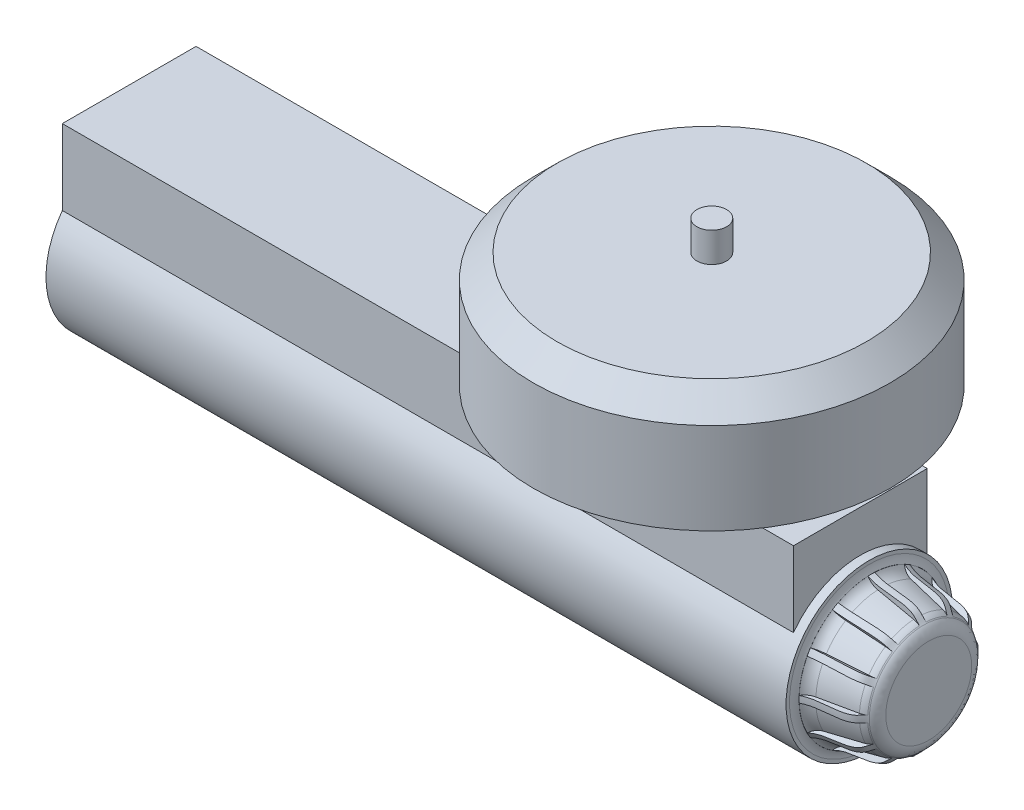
from build123d import *

# Parameters (mm, degrees)
SKETCH_1_R          = 60.05
EXTRUDE_1_DEPTH     = 49.2
SKETCH_2_W          = 246
SKETCH_2_H          = 45
EXTRUDE_2_DEPTH     = 42
SKETCH_3_R          = 28
SKETCH_3_R_2        = 25
EXTRUDE_3_DEPTH     = 246
SKETCH_4_R          = 25
CUT_EXTRUDE_1_DEPTH = 263.720388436
SKETCH_5_R          = 5
EXTRUDE_4_DEPTH     = 10
EXTRUDE_START       = 3
SKETCH_6_R          = 28
EXTRUDE_5_DEPTH     = 3
SKETCH_7_R          = 22.794562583
EXTRUDE_6_DEPTH     = 20
EXTRUDE_6_TAPER     = 12
FILLET_1_R          = 5
FILLET_2_R          = 5
EXTRUDE_7_REACH     = 286.371
SKETCH_8_W          = 2.21161749
SKETCH_8_H          = 9.865962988
SKETCH_8_W_2        = 9.865962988
SKETCH_8_H_2        = 2.21161749
CHAMFER_1_SIZE      = 8
SKETCH_12_R         = 60.05
SKETCH_12_R_2       = 26.947600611
CUT_EXTRUDE_3_DEPTH = 0.5
CHAMFER_2_SIZE      = 10
CHAMFER_2_SIZE2     = 24.750868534


with BuildPart() as part:
    # Sketch 1 → Extrude 1 (new body)
    with BuildSketch(Plane(origin=(0, 0, 0), x_dir=(1, 0, 0), z_dir=(0, 1, 0))):
        with Locations(Location((0, 0, 0), (0, 0, 270))):
            Circle(SKETCH_1_R)
    extrude(amount=EXTRUDE_1_DEPTH)

    # Sketch 2 → Extrude 2 (add)
    with BuildSketch(Plane.XZ):
        with Locations((-73, 0)):
            Rectangle(SKETCH_2_W, SKETCH_2_H)
    extrude(amount=EXTRUDE_2_DEPTH)

    # Sketch 3 → Extrude 3 (add)
    with BuildSketch(Plane(origin=(50, 0, 0), x_dir=(0, 0, -1), z_dir=(1, 0, 0))):
        with Locations((0, -42)):
            Circle(SKETCH_3_R)
        with Locations((0, -42)):
            Circle(SKETCH_3_R_2, mode=Mode.SUBTRACT)
    extrude(amount=-EXTRUDE_3_DEPTH)

    # Sketch 4 → Cut-Extrude 1 (cut, through all)
    with BuildSketch(Plane(origin=(50, 0, 0), x_dir=(0, 0, -1), z_dir=(1, 0, 0))):
        with Locations((0, -42)):
            Circle(SKETCH_4_R)
    extrude(amount=-CUT_EXTRUDE_1_DEPTH, mode=Mode.SUBTRACT)

    # Sketch 5 → Extrude 4 (add)
    with BuildSketch(Plane(origin=(0, 49.2, 0), x_dir=(1, 0, 0), z_dir=(0, 1, 0))):
        with Locations(Location((0, 0, 0), (0, 0, 270))):
            Circle(SKETCH_5_R)
    extrude(amount=EXTRUDE_4_DEPTH)

    # Sketch 6 → Extrude 5 (add)
    with BuildSketch(Plane(origin=(50, 0, 0), x_dir=(0, 0, -1), z_dir=(1, 0, 0)).offset(EXTRUDE_START)):
        with Locations((0, -42)):
            Circle(SKETCH_6_R)
    extrude(amount=-EXTRUDE_5_DEPTH)

    # Sketch 7 → Extrude 6 (add)
    with BuildSketch(Plane(origin=(53, 0, 0), x_dir=(0, 0, -1), z_dir=(1, 0, 0))):
        with Locations((0, -42)):
            Circle(SKETCH_7_R)
    extrude(amount=EXTRUDE_6_DEPTH, taper=EXTRUDE_6_TAPER)

    # Fillet 1
    fillet_1_edges = [part.edges().sort_by_distance(p)[0] for p in [
        (73, -42, 18.54343135),
    ]]
    fillet(fillet_1_edges, radius=FILLET_1_R)

    # Fillet 2
    fillet_2_edges = [part.edges().sort_by_distance(p)[0] for p in [
        (53, -42, 22.794562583),
    ]]
    fillet(fillet_2_edges, radius=FILLET_2_R)

    # Extrude 7: up to this face of the body (flat: up to its plane)
    extrude_7_end = Plane(part.part.faces().sort_by_distance((53, -42, 27.635442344))[0])
    # Sketch 8 → Extrude 7 (add, up to the picked face)
    with BuildSketch(Plane(origin=(73, 0, 0), x_dir=(0, 0, -1), z_dir=(1, 0, 0)), mode=Mode.PRIVATE) as extrude_7_sk1:
        Polygon((11.201456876, -20.386890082), (13.116773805, -21.492698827), (8.183792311, -30.036873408), (6.268475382, -28.931064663), align=None)
    extrude_7_tool1 = split(extrude(extrude_7_sk1.sketch, amount=-EXTRUDE_7_REACH, mode=Mode.PRIVATE), bisect_by=extrude_7_end, keep=Keep.BOTH, mode=Mode.PRIVATE)
    # Sketch 8 → Extrude 7 (add, up to the picked face)
    with BuildSketch(Plane(origin=(73, 0, 0), x_dir=(0, 0, -1), z_dir=(1, 0, 0)), mode=Mode.PRIVATE) as extrude_7_sk2:
        with Locations((0, -22.614750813)):
            Rectangle(SKETCH_8_W, SKETCH_8_H)
    extrude_7_tool2 = split(extrude(extrude_7_sk2.sketch, amount=-EXTRUDE_7_REACH, mode=Mode.PRIVATE), bisect_by=extrude_7_end, keep=Keep.BOTH, mode=Mode.PRIVATE)
    # Sketch 8 → Extrude 7 (add, up to the picked face)
    with BuildSketch(Plane(origin=(73, 0, 0), x_dir=(0, 0, -1), z_dir=(1, 0, 0)), mode=Mode.PRIVATE) as extrude_7_sk3:
        Polygon((20.507301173, -28.883226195), (21.613109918, -30.798543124), (13.068935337, -35.731524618), (11.963126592, -33.816207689), align=None)
    extrude_7_tool3 = split(extrude(extrude_7_sk3.sketch, amount=-EXTRUDE_7_REACH, mode=Mode.PRIVATE), bisect_by=extrude_7_end, keep=Keep.BOTH, mode=Mode.PRIVATE)
    # Sketch 8 → Extrude 7 (add, up to the picked face)
    with BuildSketch(Plane(origin=(73, 0, 0), x_dir=(0, 0, -1), z_dir=(1, 0, 0)), mode=Mode.PRIVATE) as extrude_7_sk4:
        with Locations((19.385249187, -42)):
            Rectangle(SKETCH_8_W_2, SKETCH_8_H_2)
    extrude_7_tool4 = split(extrude(extrude_7_sk4.sketch, amount=-EXTRUDE_7_REACH, mode=Mode.PRIVATE), bisect_by=extrude_7_end, keep=Keep.BOTH, mode=Mode.PRIVATE)
    # Sketch 8 → Extrude 7 (add, up to the picked face)
    with BuildSketch(Plane(origin=(73, 0, 0), x_dir=(0, 0, -1), z_dir=(1, 0, 0)), mode=Mode.PRIVATE) as extrude_7_sk5:
        Polygon((21.613109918, -53.201456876), (20.507301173, -55.116773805), (11.963126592, -50.183792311), (13.068935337, -48.268475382), align=None)
    extrude_7_tool5 = split(extrude(extrude_7_sk5.sketch, amount=-EXTRUDE_7_REACH, mode=Mode.PRIVATE), bisect_by=extrude_7_end, keep=Keep.BOTH, mode=Mode.PRIVATE)
    # Sketch 8 → Extrude 7 (add, up to the picked face)
    with BuildSketch(Plane(origin=(73, 0, 0), x_dir=(0, 0, -1), z_dir=(1, 0, 0)), mode=Mode.PRIVATE) as extrude_7_sk6:
        Polygon((13.116773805, -62.507301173), (11.201456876, -63.613109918), (6.268475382, -55.068935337), (8.183792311, -53.963126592), align=None)
    extrude_7_tool6 = split(extrude(extrude_7_sk6.sketch, amount=-EXTRUDE_7_REACH, mode=Mode.PRIVATE), bisect_by=extrude_7_end, keep=Keep.BOTH, mode=Mode.PRIVATE)
    # Sketch 8 → Extrude 7 (add, up to the picked face)
    with BuildSketch(Plane(origin=(73, 0, 0), x_dir=(0, 0, -1), z_dir=(1, 0, 0)), mode=Mode.PRIVATE) as extrude_7_sk7:
        with Locations((0, -61.385249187)):
            Rectangle(SKETCH_8_W, SKETCH_8_H)
    extrude_7_tool7 = split(extrude(extrude_7_sk7.sketch, amount=-EXTRUDE_7_REACH, mode=Mode.PRIVATE), bisect_by=extrude_7_end, keep=Keep.BOTH, mode=Mode.PRIVATE)
    # Sketch 8 → Extrude 7 (add, up to the picked face)
    with BuildSketch(Plane(origin=(73, 0, 0), x_dir=(0, 0, -1), z_dir=(1, 0, 0)), mode=Mode.PRIVATE) as extrude_7_sk8:
        Polygon((-11.201456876, -63.613109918), (-13.116773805, -62.507301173), (-8.183792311, -53.963126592), (-6.268475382, -55.068935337), align=None)
    extrude_7_tool8 = split(extrude(extrude_7_sk8.sketch, amount=-EXTRUDE_7_REACH, mode=Mode.PRIVATE), bisect_by=extrude_7_end, keep=Keep.BOTH, mode=Mode.PRIVATE)
    # Sketch 8 → Extrude 7 (add, up to the picked face)
    with BuildSketch(Plane(origin=(73, 0, 0), x_dir=(0, 0, -1), z_dir=(1, 0, 0)), mode=Mode.PRIVATE) as extrude_7_sk9:
        Polygon((-20.507301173, -55.116773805), (-21.613109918, -53.201456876), (-13.068935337, -48.268475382), (-11.963126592, -50.183792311), align=None)
    extrude_7_tool9 = split(extrude(extrude_7_sk9.sketch, amount=-EXTRUDE_7_REACH, mode=Mode.PRIVATE), bisect_by=extrude_7_end, keep=Keep.BOTH, mode=Mode.PRIVATE)
    # Sketch 8 → Extrude 7 (add, up to the picked face)
    with BuildSketch(Plane(origin=(73, 0, 0), x_dir=(0, 0, -1), z_dir=(1, 0, 0)), mode=Mode.PRIVATE) as extrude_7_sk10:
        with Locations((-19.385249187, -42)):
            Rectangle(SKETCH_8_W_2, SKETCH_8_H_2)
    extrude_7_tool10 = split(extrude(extrude_7_sk10.sketch, amount=-EXTRUDE_7_REACH, mode=Mode.PRIVATE), bisect_by=extrude_7_end, keep=Keep.BOTH, mode=Mode.PRIVATE)
    # Sketch 8 → Extrude 7 (add, up to the picked face)
    with BuildSketch(Plane(origin=(73, 0, 0), x_dir=(0, 0, -1), z_dir=(1, 0, 0)), mode=Mode.PRIVATE) as extrude_7_sk11:
        Polygon((-21.613109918, -30.798543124), (-20.507301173, -28.883226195), (-11.963126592, -33.816207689), (-13.068935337, -35.731524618), align=None)
    extrude_7_tool11 = split(extrude(extrude_7_sk11.sketch, amount=-EXTRUDE_7_REACH, mode=Mode.PRIVATE), bisect_by=extrude_7_end, keep=Keep.BOTH, mode=Mode.PRIVATE)
    # Sketch 8 → Extrude 7 (add, up to the picked face)
    with BuildSketch(Plane(origin=(73, 0, 0), x_dir=(0, 0, -1), z_dir=(1, 0, 0)), mode=Mode.PRIVATE) as extrude_7_sk12:
        Polygon((-13.116773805, -21.492698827), (-11.201456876, -20.386890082), (-6.268475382, -28.931064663), (-8.183792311, -30.036873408), align=None)
    extrude_7_tool12 = split(extrude(extrude_7_sk12.sketch, amount=-EXTRUDE_7_REACH, mode=Mode.PRIVATE), bisect_by=extrude_7_end, keep=Keep.BOTH, mode=Mode.PRIVATE)
    add(extrude_7_tool1.solids().sort_by(Axis((73, -25.211882, -9.692625), (-1, 0, 0)))[0])
    add(extrude_7_tool2.solids().sort_by(Axis((73, -22.614751, 0), (-1, 0, 0)))[0])
    add(extrude_7_tool3.solids().sort_by(Axis((73, -32.307375, -16.788118), (-1, 0, 0)))[0])
    add(extrude_7_tool4.solids().sort_by(Axis((73, -42, -19.385249), (-1, 0, 0)))[0])
    add(extrude_7_tool5.solids().sort_by(Axis((73, -51.692625, -16.788118), (-1, 0, 0)))[0])
    add(extrude_7_tool6.solids().sort_by(Axis((73, -58.788118, -9.692625), (-1, 0, 0)))[0])
    add(extrude_7_tool7.solids().sort_by(Axis((73, -61.385249, 0), (-1, 0, 0)))[0])
    add(extrude_7_tool8.solids().sort_by(Axis((73, -58.788118, 9.692625), (-1, 0, 0)))[0])
    add(extrude_7_tool9.solids().sort_by(Axis((73, -51.692625, 16.788118), (-1, 0, 0)))[0])
    add(extrude_7_tool10.solids().sort_by(Axis((73, -42, 19.385249), (-1, 0, 0)))[0])
    add(extrude_7_tool11.solids().sort_by(Axis((73, -32.307375, 16.788118), (-1, 0, 0)))[0])
    add(extrude_7_tool12.solids().sort_by(Axis((73, -25.211882, 9.692625), (-1, 0, 0)))[0])

    # Sketch 11 → Cut-Revolve 6 (revolve, cut)
    with BuildSketch(Plane(origin=(0, -42, 0), x_dir=(1, 0, 0), z_dir=(0, 1, 0))):
        with BuildLine():
            Line((53.669944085, 24.318230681), (73, 34.210650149))
            Line((73, 34.210650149), (73, 14.452267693))
            add(Edge.make_bspline(
                [(71.259579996, 18.253161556), (71.487837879, 18.056661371), (71.697880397, 17.839444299), (72.249114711, 17.155667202), (72.524142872, 16.662150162), (72.9048436, 15.581911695), (73, 15.02485894), (73, 14.452267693)],
                knots=[0.366686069, 0.366686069, 0.366686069, 0.366686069, 0.5, 0.5, 0.75, 0.75, 1, 1, 1, 1], degree=3))
            add(Edge.make_bspline(
                [(53.669944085, 24.318230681), (58.711813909, 21.771475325), (67.348508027, 23.61829704), (70.339979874, 19.04481699), (71.259579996, 18.253161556)],
                knots=[0, 0, 0, 0, 0.791781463, 1, 1, 1, 1], degree=3))
        make_face()
    revolve(axis=Axis((73, -42, 0), (-1, 0, 0)), mode=Mode.SUBTRACT)

    # Chamfer 1
    chamfer_1_edges = [part.edges().sort_by_distance(p)[0] for p in [
        (0, 49.2, -60.05),
    ]]
    chamfer(chamfer_1_edges, length=CHAMFER_1_SIZE)

    # Sketch 12 → Cut-Extrude 3 (cut)
    with BuildSketch(Plane.XZ):
        with Locations(Location((0, 0, 0), (0, 0, 270))):
            Circle(SKETCH_12_R)
        with Locations(Location((0, 0, 0), (0, 0, 270))):
            Circle(SKETCH_12_R_2, mode=Mode.SUBTRACT)
    extrude(amount=-CUT_EXTRUDE_3_DEPTH, mode=Mode.SUBTRACT)

    # Chamfer 2
    chamfer_2_edges = [part.edges().sort_by_distance(p)[0] for p in [
        (0, 0.5, -60.05),
    ]]
    chamfer_2_side = [part.faces().sort_by_distance(p)[0] for p in [
        (0, 20.85, -60.05),
    ]]
    chamfer(chamfer_2_edges, length=CHAMFER_2_SIZE, length2=CHAMFER_2_SIZE2, reference=chamfer_2_side[0])


solid = part.part
